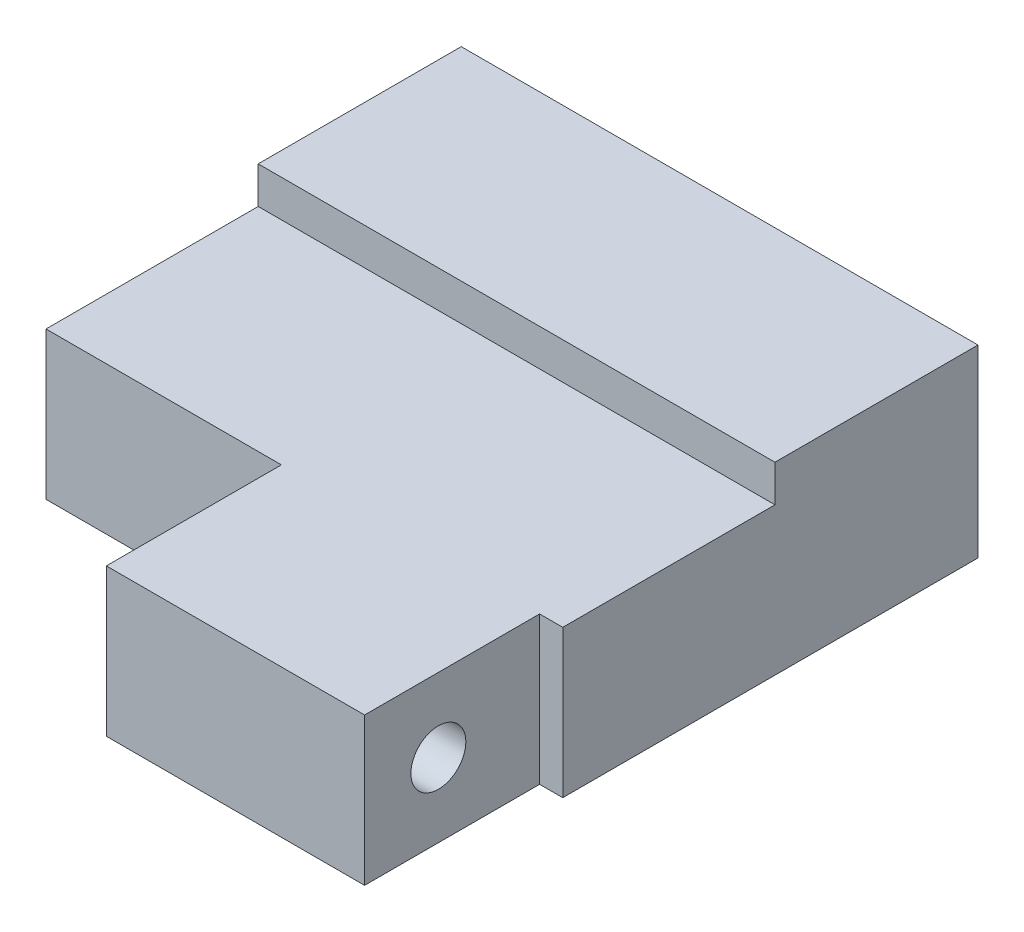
from build123d import *

# Parameters (mm, degrees)
SKETCH2_W           = 44.4754
SKETCH2_H           = 15.875
BOSS_EXTRUDE1_DEPTH = 50.8
SKETCH3_W           = 1.9939
SKETCH3_H           = 15.0622
SKETCH3_W_2         = 20.2565
CUT_EXTRUDE1_DEPTH  = 12.7
SKETCH4_R           = 2.365160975
CUT_EXTRUDE2_DEPTH  = 25.4
SKETCH5_R           = 2.3876
CUT_EXTRUDE3_DEPTH  = 15.875
SKETCH6_W           = 33.3248
SKETCH6_H           = 3.175
CUT_EXTRUDE5_DEPTH  = 38.1


with BuildPart() as part:
    # Sketch2 → Boss-Extrude1 (new body)
    with BuildSketch(Plane.XY):
        with Locations((0, -3.1623)):
            Rectangle(SKETCH2_W, SKETCH2_H)
    extrude(amount=BOSS_EXTRUDE1_DEPTH)

    # Sketch3 → Cut-Extrude1 (cut, symmetric)
    with BuildSketch(Plane(origin=(0, 0, 0), x_dir=(1, 0, 0), z_dir=(0, 1, 0))):
        with Locations((21.24075, -43.2689)):
            Rectangle(SKETCH3_W, SKETCH3_H)
        with Locations((-12.10945, -43.2689)):
            Rectangle(SKETCH3_W_2, SKETCH3_H)
    extrude(amount=CUT_EXTRUDE1_DEPTH, both=True, mode=Mode.SUBTRACT)

    # Sketch4 → Cut-Extrude2 (cut, symmetric)
    with BuildSketch(Plane(origin=(0, 0, 0), x_dir=(0, 0, -1), z_dir=(1, 0, 0))):
        with Locations((-44.45, -4.7498)):
            Circle(SKETCH4_R)
    extrude(amount=CUT_EXTRUDE2_DEPTH, both=True, mode=Mode.SUBTRACT)

    # Sketch5 → Cut-Extrude3 (cut)
    with BuildSketch(Plane(origin=(0, 0, 0), x_dir=(-1, 0, 0), z_dir=(0, 0, -1))):
        with Locations((-17.4625, 0)):
            Circle(SKETCH5_R)
        with Locations((17.4625, 0)):
            Circle(SKETCH5_R)
    extrude(amount=-CUT_EXTRUDE3_DEPTH, mode=Mode.SUBTRACT)

    # Sketch6 → Cut-Extrude5 (cut, symmetric)
    with BuildSketch(Plane(origin=(0, 0, 0), x_dir=(0, 0, -1), z_dir=(1, 0, 0))):
        with Locations((-34.1376, 3.1877)):
            Rectangle(SKETCH6_W, SKETCH6_H)
    extrude(amount=CUT_EXTRUDE5_DEPTH, both=True, mode=Mode.SUBTRACT)


solid = part.part
